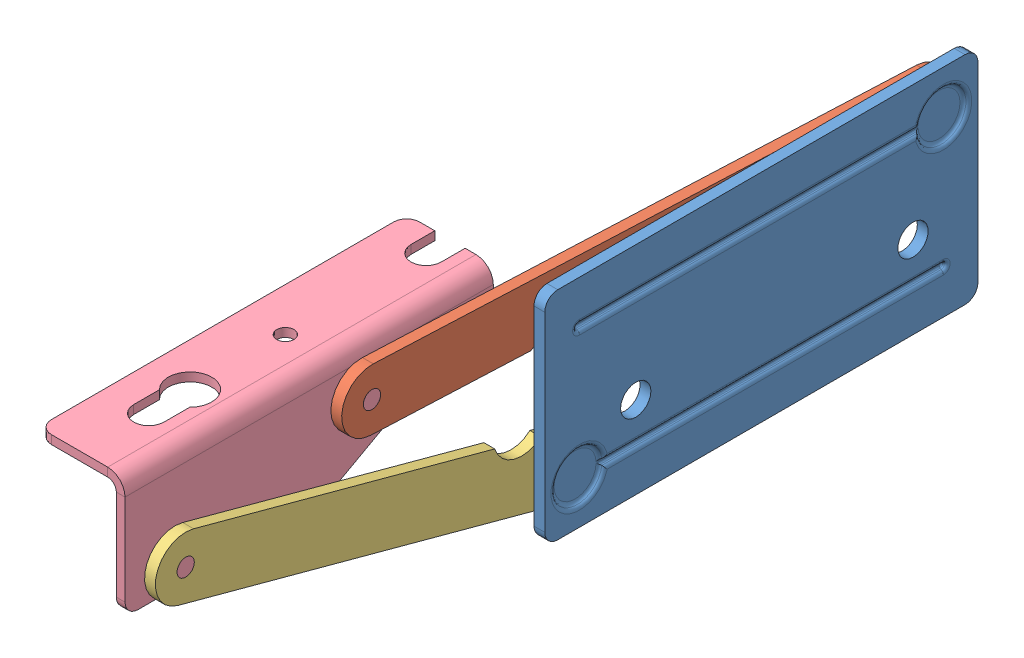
SolidWorks assembly Hinge LH.SLDASM, configuration Default (file format 10210). Lengths in mm.
Overall size (27 55.48 189.88).
4 component instances, 4 part files, 8 mates.
Components (placement in the parent):
- Hinge Plate LH-1: Hinge Plate LH.SLDPRT [Default] at (20.6465 3.4946 -13.2691) size (8.5 50 100)
- Hinge Long Arm-1: Hinge Long Arm.SLDPRT [Default] at (19.1465 50.4882 -5.5689) x (-1 0 0) z (0 -0.042832 -0.999082) size (2.5 14 142)
- Hinge Short Arm-1: Hinge Short Arm.SLDPRT [Default] at (16.6465 6.7371 80.5573) x (1 0 0) z (0 -0.260916 -0.965362) size (2.5 14 104)
- Hinge Mount LH -1: Hinge Mount LH .SLDPRT [Default] at (16.1465 30.977 91.6135) size (23 28 85)
Mates (geometry in assembly coordinates):
- Coincident2: coincident: cylinder of Hinge Plate LH-1 through (16.6465 43.4946 -5.2691) axis (1 0 0) radius 2.5; circle of Hinge Long Arm-1
- Coincident3: coincident: circle of Hinge Plate LH-1; plane of Hinge Long Arm-1 through (16.6465 43.4946 -5.2691) normal (-1 0 0)
- Coincident4: coincident: plane of Hinge Plate LH-1 through (16.6465 13.4946 78.7309) normal (1 0 0); plane of Hinge Short Arm-1 through (16.6465 13.4946 78.7309) normal (-1 0 0)
- Concentric3: concentric: cylinder of Hinge Long Arm-1 through (16.6465 48.977 122.6135) axis (-1 0 0) radius 2; cylinder of Hinge Mount LH -1 through (19.1465 48.977 122.6135) axis (-1 0 0) radius 2
- Coincident5: coincident: circle of Hinge Long Arm-1; circle of Hinge Mount LH -1
- Concentric4: concentric: circle of Hinge Short Arm-1; cylinder of Hinge Mount LH -1 through (19.1465 36.977 165.6135) axis (-1 0 0) radius 2
- Concentric5: concentric: cylinder of Hinge Plate LH-1 through (16.6465 13.4946 78.7309) axis (1 0 0) radius 2.5; cylinder of Hinge Short Arm-1 through (19.1465 13.4946 78.7309) axis (1 0 0) radius 2.5
- LimitAngle1: limit planar angle: plane of Hinge Mount LH -1 through (16.1465 58.977 176.6135) normal (0 1 0); plane of Hinge Plate LH-1 through (23.1465 53.4946 -13.2691) normal (0 1 0)
